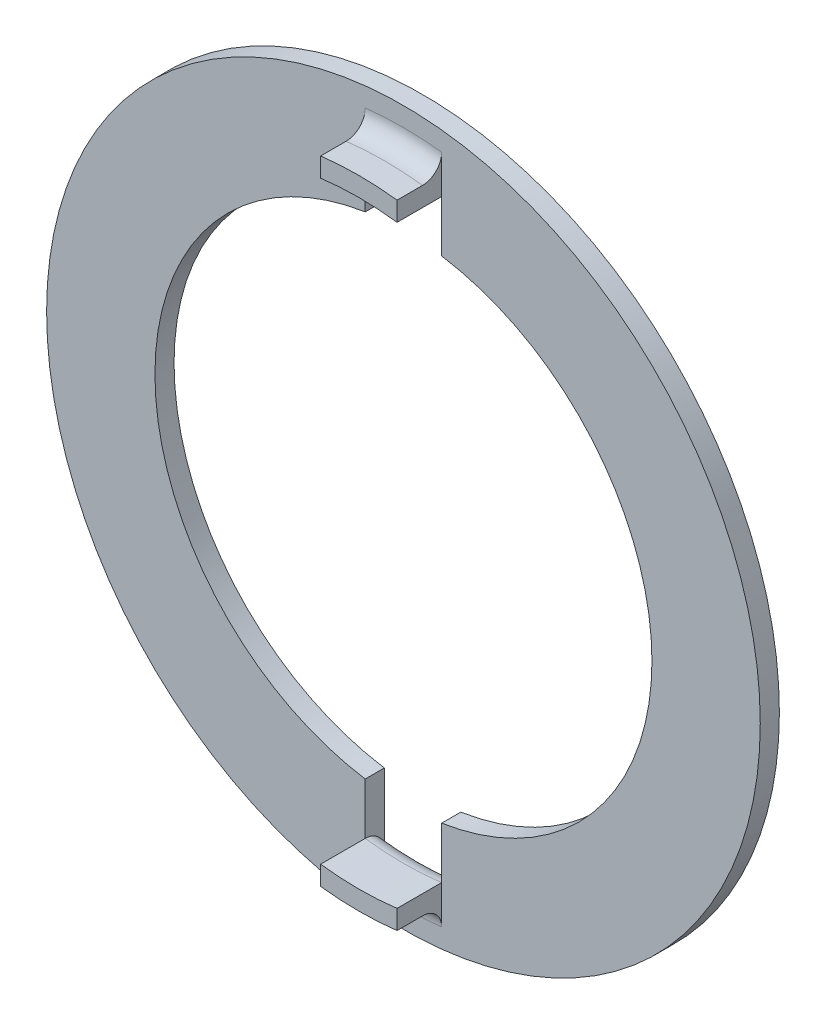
from build123d import *

# Parameters (mm, degrees)
ESQUISSE4_R             = 28
BASE_EXTRUSION_DEPTH    = 1.5
ESQUISSE5_R             = 19.5
ENL_V_MAT_EXTRU_1_DEPTH = 1.5
ENL_V_MAT_EXTRU_2_DEPTH = 1.5
BOSS_EXTRU_2_START      = 3.5
BOSS_EXTRU_2_DEPTH      = 3.5
CONG_1_R                = 1.5


with BuildPart() as part:
    # Esquisse4 → Base-Extrusion (new body)
    with BuildSketch(Plane.XY):
        with Locations(Location((0, 0, 0), (0, 0, 180))):
            Circle(ESQUISSE4_R)
    extrude(amount=BASE_EXTRUSION_DEPTH)

    # Esquisse5 → Enl_v. mat.-Extru.1 (cut)
    with BuildSketch(Plane.XY.offset(1.5)):
        Circle(ESQUISSE5_R)
    extrude(amount=-ENL_V_MAT_EXTRU_1_DEPTH, mode=Mode.SUBTRACT)

    # Esquisse6 → Enl_v. mat.-Extru.2 (cut)
    with BuildSketch(Plane.XY.offset(1.5)):
        with BuildLine():
            Line((-3, 23.307724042), (-3, 19.267848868))
            ThreePointArc((-3, 19.267848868), (0, 19.5), (3, 19.267848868))
            Line((3, 19.267848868), (3, 23.307724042))
            ThreePointArc((3, 23.307724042), (0, 23.5), (-3, 23.307724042))
        make_face()
        with BuildLine():
            Line((-3, -19.267848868), (-3, -23.307724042))
            ThreePointArc((-3, -23.307724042), (0, -23.5), (3, -23.307724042))
            Line((3, -23.307724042), (3, -19.267848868))
            ThreePointArc((3, -19.267848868), (0, -19.5), (-3, -19.267848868))
        make_face()
    extrude(amount=-ENL_V_MAT_EXTRU_2_DEPTH, mode=Mode.SUBTRACT)

    # Esquisse8 → Boss.-Extru.2 (add)
    with BuildSketch(Plane.XY.offset(1.5).offset(BOSS_EXTRU_2_START)):
        with BuildLine():
            Line((-3, 24.819347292), (-3, 23.307724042))
            ThreePointArc((-3, 23.307724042), (0, 23.5), (3, 23.307724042))
            Line((3, 23.307724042), (3, 24.819347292))
            ThreePointArc((3, 24.819347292), (0, 25), (-3, 24.819347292))
        make_face()
        with BuildLine():
            Line((3, -23.307724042), (3, -24.819347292))
            ThreePointArc((3, -24.819347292), (0, -25), (-3, -24.819347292))
            Line((-3, -24.819347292), (-3, -23.307724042))
            ThreePointArc((-3, -23.307724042), (0, -23.5), (3, -23.307724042))
        make_face()
    extrude(amount=-BOSS_EXTRU_2_DEPTH)

    # Cong_1
    cong_1_edges = [part.edges().sort_by_distance(p)[0] for p in [
        (0, -23.5, 0),
        (0, 23.5, 0),
        (0, 25, 1.5),
        (0, -25, 1.5),
    ]]
    fillet(cong_1_edges, radius=CONG_1_R)


solid = part.part
